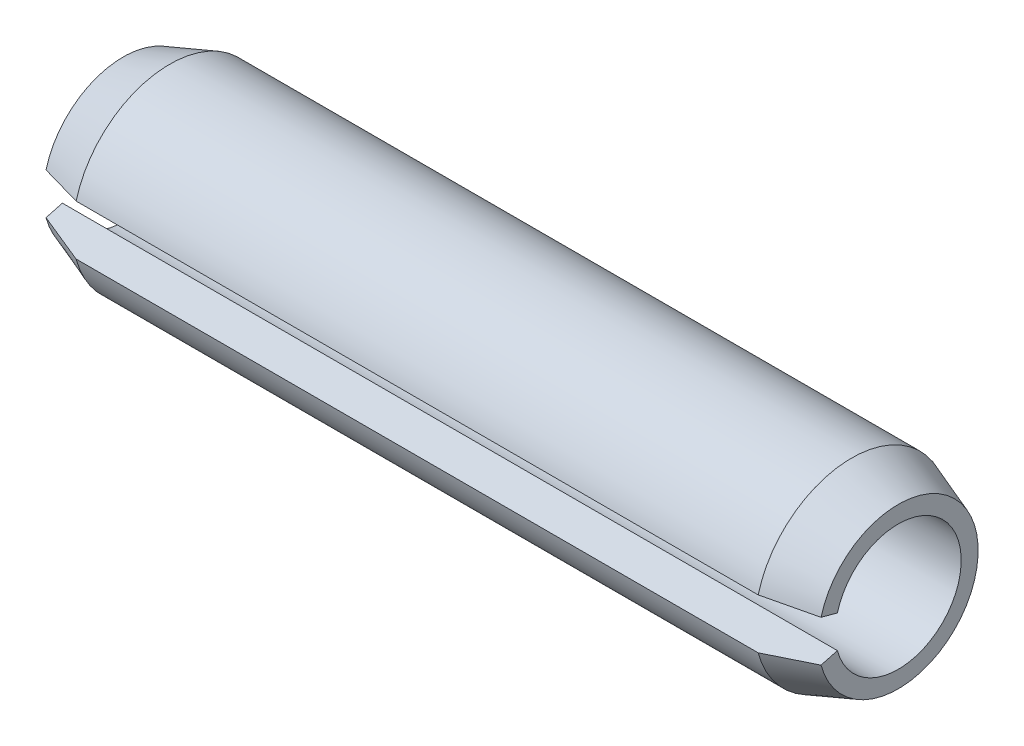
ISO-10303-21;
HEADER;
FILE_DESCRIPTION(('STEP AP214'),'2;1');
FILE_NAME('part.step','',(''),(''),'','','');
FILE_SCHEMA(('AUTOMOTIVE_DESIGN { 1 0 10303 214 1 1 1 1 }'));
ENDSEC;
DATA;
#1=APPLICATION_CONTEXT('core data for automotive mechanical design processes');
#2=APPLICATION_PROTOCOL_DEFINITION('international standard','automotive_design',2000,#1);
#3=PRODUCT_CONTEXT('',#1,'mechanical');
#4=PRODUCT('Part','Part','',(#3));
#5=PRODUCT_RELATED_PRODUCT_CATEGORY('part','',(#4));
#6=PRODUCT_DEFINITION_FORMATION('','',#4);
#7=PRODUCT_DEFINITION_CONTEXT('part definition',#1,'design');
#8=PRODUCT_DEFINITION('design','',#6,#7);
#9=PRODUCT_DEFINITION_SHAPE('','',#8);
#10=(LENGTH_UNIT() NAMED_UNIT(*) SI_UNIT(.MILLI.,.METRE.));
#11=(NAMED_UNIT(*) PLANE_ANGLE_UNIT() SI_UNIT($,.RADIAN.));
#12=(NAMED_UNIT(*) SI_UNIT($,.STERADIAN.) SOLID_ANGLE_UNIT());
#13=UNCERTAINTY_MEASURE_WITH_UNIT(LENGTH_MEASURE(1.E-05),#10,'distance_accuracy_value','');
#14=(GEOMETRIC_REPRESENTATION_CONTEXT(3) GLOBAL_UNCERTAINTY_ASSIGNED_CONTEXT((#13)) GLOBAL_UNIT_ASSIGNED_CONTEXT((#10,
#11,#12)) REPRESENTATION_CONTEXT('',''));
#15=CARTESIAN_POINT('',(0.,0.,0.));
#16=DIRECTION('',(0.,0.,1.));
#17=DIRECTION('',(1.,0.,0.));
#18=AXIS2_PLACEMENT_3D('',#15,#16,#17);
#19=CARTESIAN_POINT('',(0.,0.,-4.125));
#20=DIRECTION('',(1.,0.,0.));
#21=DIRECTION('',(0.,0.,-1.));
#22=AXIS2_PLACEMENT_3D('',#19,#20,#21);
#23=PLANE('',#22);
#24=DIRECTION('',(0.,0.258819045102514,-0.96592582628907));
#25=VECTOR('',#24,1.);
#26=CARTESIAN_POINT('',(0.,0.,0.));
#27=LINE('',#26,#25);
#28=CARTESIAN_POINT('',(0.,-1.06762856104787,3.98444403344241));
#29=VERTEX_POINT('',#28);
#30=CARTESIAN_POINT('',(0.,-0.841161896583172,3.13925893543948));
#31=VERTEX_POINT('',#30);
#32=EDGE_CURVE('E53',#29,#31,#27,.T.);
#33=ORIENTED_EDGE('',*,*,#32,.T.);
#34=CARTESIAN_POINT('',(0.,0.,0.));
#35=DIRECTION('',(-1.,0.,0.));
#36=DIRECTION('',(0.,0.,1.));
#37=AXIS2_PLACEMENT_3D('',#34,#35,#36);
#38=CIRCLE('',#37,3.25);
#39=CARTESIAN_POINT('',(0.,0.841161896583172,3.13925893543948));
#40=VERTEX_POINT('',#39);
#41=EDGE_CURVE('E96',#40,#31,#38,.T.);
#42=ORIENTED_EDGE('',*,*,#41,.F.);
#43=DIRECTION('',(0.,0.258819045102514,0.96592582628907));
#44=VECTOR('',#43,1.);
#45=CARTESIAN_POINT('',(0.,0.,0.));
#46=LINE('',#45,#44);
#47=CARTESIAN_POINT('',(0.,1.06762856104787,3.98444403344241));
#48=VERTEX_POINT('',#47);
#49=EDGE_CURVE('E98',#40,#48,#46,.T.);
#50=ORIENTED_EDGE('',*,*,#49,.T.);
#51=CARTESIAN_POINT('',(0.,0.,0.));
#52=DIRECTION('',(-1.,0.,0.));
#53=DIRECTION('',(0.,0.,1.));
#54=AXIS2_PLACEMENT_3D('',#51,#52,#53);
#55=CIRCLE('',#54,4.125);
#56=EDGE_CURVE('E89',#48,#29,#55,.T.);
#57=ORIENTED_EDGE('',*,*,#56,.T.);
#58=EDGE_LOOP('',(#33,#42,#50,#57));
#59=FACE_BOUND('',#58,.T.);
#60=ADVANCED_FACE('F32',(#59),#23,.F.);
#61=CARTESIAN_POINT('',(0.,0.,0.));
#62=DIRECTION('',(-1.,0.,0.));
#63=DIRECTION('',(0.,0.,1.));
#64=AXIS2_PLACEMENT_3D('',#61,#62,#63);
#65=CYLINDRICAL_SURFACE('',#64,3.25);
#66=DIRECTION('',(-1.,0.,0.));
#67=VECTOR('',#66,1.);
#68=CARTESIAN_POINT('',(0.,-0.841161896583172,3.13925893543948));
#69=LINE('',#68,#67);
#70=CARTESIAN_POINT('',(40.,-0.841161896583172,3.13925893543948));
#71=VERTEX_POINT('',#70);
#72=EDGE_CURVE('E81',#71,#31,#69,.T.);
#73=ORIENTED_EDGE('',*,*,#72,.F.);
#74=CARTESIAN_POINT('',(40.,0.,0.));
#75=DIRECTION('',(-1.,0.,0.));
#76=DIRECTION('',(0.,0.,1.));
#77=AXIS2_PLACEMENT_3D('',#74,#75,#76);
#78=CIRCLE('',#77,3.25);
#79=CARTESIAN_POINT('',(40.,0.841161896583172,3.13925893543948));
#80=VERTEX_POINT('',#79);
#81=EDGE_CURVE('E103',#80,#71,#78,.T.);
#82=ORIENTED_EDGE('',*,*,#81,.F.);
#83=DIRECTION('',(-1.,0.,0.));
#84=VECTOR('',#83,1.);
#85=CARTESIAN_POINT('',(0.,0.841161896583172,3.13925893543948));
#86=LINE('',#85,#84);
#87=EDGE_CURVE('E102',#40,#80,#86,.F.);
#88=ORIENTED_EDGE('',*,*,#87,.F.);
#89=ORIENTED_EDGE('',*,*,#41,.T.);
#90=EDGE_LOOP('',(#73,#82,#88,#89));
#91=FACE_BOUND('',#90,.T.);
#92=ADVANCED_FACE('F101',(#91),#65,.F.);
#93=CARTESIAN_POINT('',(40.,0.,-4.12500000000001));
#94=DIRECTION('',(-1.,0.,0.));
#95=DIRECTION('',(0.,0.,1.));
#96=AXIS2_PLACEMENT_3D('',#93,#94,#95);
#97=PLANE('',#96);
#98=DIRECTION('',(0.,0.258819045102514,-0.96592582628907));
#99=VECTOR('',#98,1.);
#100=CARTESIAN_POINT('',(40.,0.,0.));
#101=LINE('',#100,#99);
#102=CARTESIAN_POINT('',(40.,-1.06762856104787,3.98444403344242));
#103=VERTEX_POINT('',#102);
#104=EDGE_CURVE('E84',#103,#71,#101,.T.);
#105=ORIENTED_EDGE('',*,*,#104,.F.);
#106=CARTESIAN_POINT('',(40.,0.,0.));
#107=DIRECTION('',(-1.,0.,0.));
#108=DIRECTION('',(0.,0.,1.));
#109=AXIS2_PLACEMENT_3D('',#106,#107,#108);
#110=CIRCLE('',#109,4.12500000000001);
#111=CARTESIAN_POINT('',(40.,1.06762856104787,3.98444403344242));
#112=VERTEX_POINT('',#111);
#113=EDGE_CURVE('E105',#112,#103,#110,.T.);
#114=ORIENTED_EDGE('',*,*,#113,.F.);
#115=DIRECTION('',(0.,0.258819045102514,0.96592582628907));
#116=VECTOR('',#115,1.);
#117=CARTESIAN_POINT('',(40.,0.,0.));
#118=LINE('',#117,#116);
#119=EDGE_CURVE('E125',#80,#112,#118,.T.);
#120=ORIENTED_EDGE('',*,*,#119,.F.);
#121=ORIENTED_EDGE('',*,*,#81,.T.);
#122=EDGE_LOOP('',(#105,#114,#120,#121));
#123=FACE_BOUND('',#122,.T.);
#124=ADVANCED_FACE('F137',(#123),#97,.F.);
#125=CARTESIAN_POINT('',(40.,0.,0.));
#126=DIRECTION('',(-1.,0.,0.));
#127=DIRECTION('',(0.,0.,1.));
#128=AXIS2_PLACEMENT_3D('',#125,#126,#127);
#129=CONICAL_SURFACE('',#128,4.12500000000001,0.3496071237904);
#130=DIRECTION('',(0.939507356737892,0.0886529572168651,-0.330857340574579));
#131=VECTOR('',#130,1.);
#132=CARTESIAN_POINT('',(51.3142857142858,0.,0.));
#133=LINE('',#132,#131);
#134=CARTESIAN_POINT('',(37.6,-1.29409522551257,4.82962913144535));
#135=VERTEX_POINT('',#134);
#136=EDGE_CURVE('E90',#135,#103,#133,.T.);
#137=ORIENTED_EDGE('',*,*,#136,.F.);
#138=CARTESIAN_POINT('',(37.6,0.,0.));
#139=DIRECTION('',(-1.,0.,0.));
#140=DIRECTION('',(0.,0.,1.));
#141=AXIS2_PLACEMENT_3D('',#138,#139,#140);
#142=CIRCLE('',#141,5.);
#143=CARTESIAN_POINT('',(37.6,1.29409522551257,4.82962913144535));
#144=VERTEX_POINT('',#143);
#145=EDGE_CURVE('E110',#144,#135,#142,.T.);
#146=ORIENTED_EDGE('',*,*,#145,.F.);
#147=DIRECTION('',(-0.939507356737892,0.0886529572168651,0.330857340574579));
#148=VECTOR('',#147,1.);
#149=CARTESIAN_POINT('',(51.3142857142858,0.,0.));
#150=LINE('',#149,#148);
#151=EDGE_CURVE('E119',#112,#144,#150,.T.);
#152=ORIENTED_EDGE('',*,*,#151,.F.);
#153=ORIENTED_EDGE('',*,*,#113,.T.);
#154=EDGE_LOOP('',(#137,#146,#152,#153));
#155=FACE_BOUND('',#154,.T.);
#156=ADVANCED_FACE('F136',(#155),#129,.T.);
#157=CARTESIAN_POINT('',(0.,0.,0.));
#158=DIRECTION('',(-1.,0.,0.));
#159=DIRECTION('',(0.,0.,1.));
#160=AXIS2_PLACEMENT_3D('',#157,#158,#159);
#161=CYLINDRICAL_SURFACE('',#160,5.);
#162=DIRECTION('',(-1.,0.,0.));
#163=VECTOR('',#162,1.);
#164=CARTESIAN_POINT('',(40.,-1.29409522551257,4.82962913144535));
#165=LINE('',#164,#163);
#166=CARTESIAN_POINT('',(2.4,-1.29409522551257,4.82962913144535));
#167=VERTEX_POINT('',#166);
#168=EDGE_CURVE('E122',#135,#167,#165,.T.);
#169=ORIENTED_EDGE('',*,*,#168,.T.);
#170=CARTESIAN_POINT('',(2.4,0.,0.));
#171=DIRECTION('',(-1.,0.,0.));
#172=DIRECTION('',(0.,0.,1.));
#173=AXIS2_PLACEMENT_3D('',#170,#171,#172);
#174=CIRCLE('',#173,5.);
#175=CARTESIAN_POINT('',(2.4,1.29409522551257,4.82962913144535));
#176=VERTEX_POINT('',#175);
#177=EDGE_CURVE('E113',#176,#167,#174,.T.);
#178=ORIENTED_EDGE('',*,*,#177,.F.);
#179=DIRECTION('',(-1.,0.,0.));
#180=VECTOR('',#179,1.);
#181=CARTESIAN_POINT('',(40.,1.29409522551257,4.82962913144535));
#182=LINE('',#181,#180);
#183=EDGE_CURVE('E46',#144,#176,#182,.T.);
#184=ORIENTED_EDGE('',*,*,#183,.F.);
#185=ORIENTED_EDGE('',*,*,#145,.T.);
#186=EDGE_LOOP('',(#169,#178,#184,#185));
#187=FACE_BOUND('',#186,.T.);
#188=ADVANCED_FACE('F144',(#187),#161,.T.);
#189=CARTESIAN_POINT('',(2.4,0.,0.));
#190=DIRECTION('',(1.,0.,0.));
#191=DIRECTION('',(0.,0.,-1.));
#192=AXIS2_PLACEMENT_3D('',#189,#190,#191);
#193=CONICAL_SURFACE('',#192,5.,0.349607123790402);
#194=DIRECTION('',(0.939507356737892,-0.0886529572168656,0.330857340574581));
#195=VECTOR('',#194,1.);
#196=CARTESIAN_POINT('',(-11.3142857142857,0.,0.));
#197=LINE('',#196,#195);
#198=EDGE_CURVE('E11',#29,#167,#197,.T.);
#199=ORIENTED_EDGE('',*,*,#198,.F.);
#200=ORIENTED_EDGE('',*,*,#56,.F.);
#201=DIRECTION('',(-0.939507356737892,-0.0886529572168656,-0.330857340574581));
#202=VECTOR('',#201,1.);
#203=CARTESIAN_POINT('',(-11.3142857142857,0.,0.));
#204=LINE('',#203,#202);
#205=EDGE_CURVE('E39',#176,#48,#204,.T.);
#206=ORIENTED_EDGE('',*,*,#205,.F.);
#207=ORIENTED_EDGE('',*,*,#177,.T.);
#208=EDGE_LOOP('',(#199,#200,#206,#207));
#209=FACE_BOUND('',#208,.T.);
#210=ADVANCED_FACE('F172',(#209),#193,.T.);
#211=CARTESIAN_POINT('',(40.,0.,0.));
#212=DIRECTION('',(0.,-0.96592582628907,0.258819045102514));
#213=DIRECTION('',(0.,-0.258819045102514,-0.96592582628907));
#214=AXIS2_PLACEMENT_3D('',#211,#212,#213);
#215=PLANE('',#214);
#216=ORIENTED_EDGE('',*,*,#87,.T.);
#217=ORIENTED_EDGE('',*,*,#119,.T.);
#218=ORIENTED_EDGE('',*,*,#151,.T.);
#219=ORIENTED_EDGE('',*,*,#183,.T.);
#220=ORIENTED_EDGE('',*,*,#205,.T.);
#221=ORIENTED_EDGE('',*,*,#49,.F.);
#222=EDGE_LOOP('',(#216,#217,#218,#219,#220,#221));
#223=FACE_BOUND('',#222,.T.);
#224=ADVANCED_FACE('F130',(#223),#215,.T.);
#225=CARTESIAN_POINT('',(40.,0.,0.));
#226=DIRECTION('',(0.,0.96592582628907,0.258819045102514));
#227=DIRECTION('',(0.,-0.258819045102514,0.96592582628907));
#228=AXIS2_PLACEMENT_3D('',#225,#226,#227);
#229=PLANE('',#228);
#230=ORIENTED_EDGE('',*,*,#72,.T.);
#231=ORIENTED_EDGE('',*,*,#32,.F.);
#232=ORIENTED_EDGE('',*,*,#198,.T.);
#233=ORIENTED_EDGE('',*,*,#168,.F.);
#234=ORIENTED_EDGE('',*,*,#136,.T.);
#235=ORIENTED_EDGE('',*,*,#104,.T.);
#236=EDGE_LOOP('',(#230,#231,#232,#233,#234,#235));
#237=FACE_BOUND('',#236,.T.);
#238=ADVANCED_FACE('F82',(#237),#229,.T.);
#239=CLOSED_SHELL('',(#60,#92,#124,#156,#188,#210,#224,#238));
#240=MANIFOLD_SOLID_BREP('B2',#239);
#241=ADVANCED_BREP_SHAPE_REPRESENTATION('',(#18,#240),#14);
#242=SHAPE_DEFINITION_REPRESENTATION(#9,#241);
ENDSEC;
END-ISO-10303-21;
